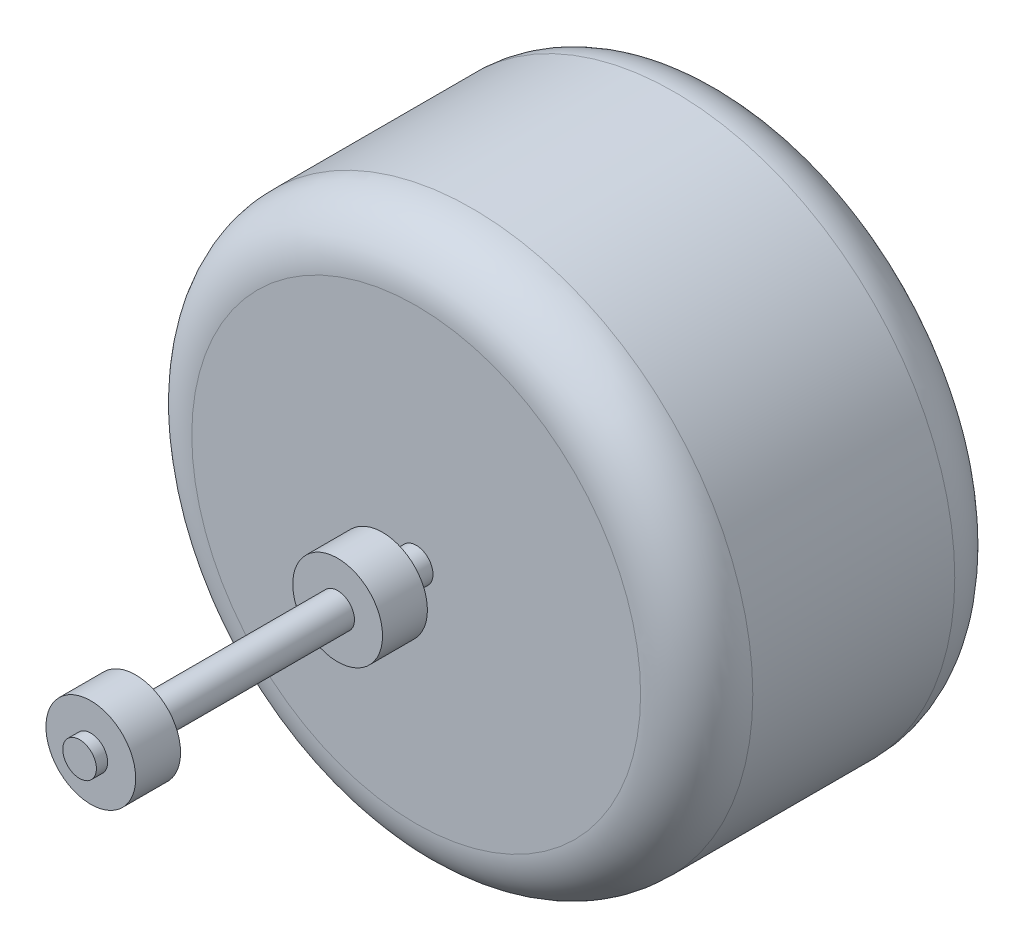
ISO-10303-21;
HEADER;
FILE_DESCRIPTION(('STEP AP214'),'2;1');
FILE_NAME('part.step','',(''),(''),'','','');
FILE_SCHEMA(('AUTOMOTIVE_DESIGN { 1 0 10303 214 1 1 1 1 }'));
ENDSEC;
DATA;
#1=APPLICATION_CONTEXT('core data for automotive mechanical design processes');
#2=APPLICATION_PROTOCOL_DEFINITION('international standard','automotive_design',2000,#1);
#3=PRODUCT_CONTEXT('',#1,'mechanical');
#4=PRODUCT('Part','Part','',(#3));
#5=PRODUCT_RELATED_PRODUCT_CATEGORY('part','',(#4));
#6=PRODUCT_DEFINITION_FORMATION('','',#4);
#7=PRODUCT_DEFINITION_CONTEXT('part definition',#1,'design');
#8=PRODUCT_DEFINITION('design','',#6,#7);
#9=PRODUCT_DEFINITION_SHAPE('','',#8);
#10=(LENGTH_UNIT() NAMED_UNIT(*) SI_UNIT(.MILLI.,.METRE.));
#11=(NAMED_UNIT(*) PLANE_ANGLE_UNIT() SI_UNIT($,.RADIAN.));
#12=(NAMED_UNIT(*) SI_UNIT($,.STERADIAN.) SOLID_ANGLE_UNIT());
#13=UNCERTAINTY_MEASURE_WITH_UNIT(LENGTH_MEASURE(1.E-05),#10,'distance_accuracy_value','');
#14=(GEOMETRIC_REPRESENTATION_CONTEXT(3) GLOBAL_UNCERTAINTY_ASSIGNED_CONTEXT((#13)) GLOBAL_UNIT_ASSIGNED_CONTEXT((#10,
#11,#12)) REPRESENTATION_CONTEXT('',''));
#15=CARTESIAN_POINT('',(0.,0.,0.));
#16=DIRECTION('',(0.,0.,1.));
#17=DIRECTION('',(1.,0.,0.));
#18=AXIS2_PLACEMENT_3D('',#15,#16,#17);
#19=CARTESIAN_POINT('',(0.,0.,44.));
#20=DIRECTION('',(0.,0.,-1.));
#21=DIRECTION('',(-1.,0.,0.));
#22=AXIS2_PLACEMENT_3D('',#19,#20,#21);
#23=CYLINDRICAL_SURFACE('',#22,1.5);
#24=CARTESIAN_POINT('',(0.,0.,21.));
#25=DIRECTION('',(0.,0.,1.));
#26=DIRECTION('',(1.,0.,0.));
#27=AXIS2_PLACEMENT_3D('',#24,#25,#26);
#28=CIRCLE('',#27,1.5);
#29=CARTESIAN_POINT('',(1.5,0.,21.));
#30=VERTEX_POINT('',#29);
#31=EDGE_CURVE('E35',#30,#30,#28,.T.);
#32=ORIENTED_EDGE('',*,*,#31,.T.);
#33=EDGE_LOOP('',(#32));
#34=FACE_BOUND('',#33,.T.);
#35=CARTESIAN_POINT('',(0.,0.,39.));
#36=DIRECTION('',(0.,0.,1.));
#37=DIRECTION('',(1.,0.,0.));
#38=AXIS2_PLACEMENT_3D('',#35,#36,#37);
#39=CIRCLE('',#38,1.5);
#40=CARTESIAN_POINT('',(1.5,0.,39.));
#41=VERTEX_POINT('',#40);
#42=EDGE_CURVE('E39',#41,#41,#39,.T.);
#43=ORIENTED_EDGE('',*,*,#42,.F.);
#44=EDGE_LOOP('',(#43));
#45=FACE_BOUND('',#44,.T.);
#46=ADVANCED_FACE('F31',(#34,#45),#23,.T.);
#47=CARTESIAN_POINT('',(0.,0.,39.));
#48=DIRECTION('',(0.,0.,1.));
#49=DIRECTION('',(1.,0.,0.));
#50=AXIS2_PLACEMENT_3D('',#47,#48,#49);
#51=CYLINDRICAL_SURFACE('',#50,4.);
#52=CARTESIAN_POINT('',(0.,0.,39.));
#53=DIRECTION('',(0.,0.,1.));
#54=DIRECTION('',(1.,0.,0.));
#55=AXIS2_PLACEMENT_3D('',#52,#53,#54);
#56=CIRCLE('',#55,4.);
#57=CARTESIAN_POINT('',(4.,0.,39.));
#58=VERTEX_POINT('',#57);
#59=EDGE_CURVE('E50',#58,#58,#56,.T.);
#60=ORIENTED_EDGE('',*,*,#59,.T.);
#61=EDGE_LOOP('',(#60));
#62=FACE_BOUND('',#61,.T.);
#63=CARTESIAN_POINT('',(0.,0.,43.));
#64=DIRECTION('',(0.,0.,1.));
#65=DIRECTION('',(1.,0.,0.));
#66=AXIS2_PLACEMENT_3D('',#63,#64,#65);
#67=CIRCLE('',#66,4.);
#68=CARTESIAN_POINT('',(4.,0.,43.));
#69=VERTEX_POINT('',#68);
#70=EDGE_CURVE('E67',#69,#69,#67,.T.);
#71=ORIENTED_EDGE('',*,*,#70,.F.);
#72=EDGE_LOOP('',(#71));
#73=FACE_BOUND('',#72,.T.);
#74=ADVANCED_FACE('F99',(#62,#73),#51,.T.);
#75=CARTESIAN_POINT('',(0.,0.,39.));
#76=DIRECTION('',(0.,0.,1.));
#77=DIRECTION('',(1.,0.,0.));
#78=AXIS2_PLACEMENT_3D('',#75,#76,#77);
#79=PLANE('',#78);
#80=ORIENTED_EDGE('',*,*,#42,.T.);
#81=EDGE_LOOP('',(#80));
#82=FACE_BOUND('',#81,.T.);
#83=ORIENTED_EDGE('',*,*,#59,.F.);
#84=EDGE_LOOP('',(#83));
#85=FACE_BOUND('',#84,.T.);
#86=ADVANCED_FACE('F105',(#82,#85),#79,.F.);
#87=CARTESIAN_POINT('',(0.,0.,43.));
#88=DIRECTION('',(0.,0.,1.));
#89=DIRECTION('',(1.,0.,0.));
#90=AXIS2_PLACEMENT_3D('',#87,#88,#89);
#91=PLANE('',#90);
#92=CARTESIAN_POINT('',(0.,0.,43.));
#93=DIRECTION('',(0.,0.,1.));
#94=DIRECTION('',(1.,0.,0.));
#95=AXIS2_PLACEMENT_3D('',#92,#93,#94);
#96=CIRCLE('',#95,1.5);
#97=CARTESIAN_POINT('',(1.5,0.,43.));
#98=VERTEX_POINT('',#97);
#99=EDGE_CURVE('E46',#98,#98,#96,.T.);
#100=ORIENTED_EDGE('',*,*,#99,.F.);
#101=EDGE_LOOP('',(#100));
#102=FACE_BOUND('',#101,.T.);
#103=ORIENTED_EDGE('',*,*,#70,.T.);
#104=EDGE_LOOP('',(#103));
#105=FACE_BOUND('',#104,.T.);
#106=ADVANCED_FACE('F175',(#102,#105),#91,.T.);
#107=CARTESIAN_POINT('',(0.,0.,44.));
#108=DIRECTION('',(0.,0.,1.));
#109=DIRECTION('',(1.,0.,0.));
#110=AXIS2_PLACEMENT_3D('',#107,#108,#109);
#111=PLANE('',#110);
#112=CARTESIAN_POINT('',(0.,0.,44.));
#113=DIRECTION('',(0.,0.,1.));
#114=DIRECTION('',(1.,0.,0.));
#115=AXIS2_PLACEMENT_3D('',#112,#113,#114);
#116=CIRCLE('',#115,1.5);
#117=CARTESIAN_POINT('',(1.5,0.,44.));
#118=VERTEX_POINT('',#117);
#119=EDGE_CURVE('E62',#118,#118,#116,.T.);
#120=ORIENTED_EDGE('',*,*,#119,.T.);
#121=EDGE_LOOP('',(#120));
#122=FACE_BOUND('',#121,.T.);
#123=ADVANCED_FACE('F111',(#122),#111,.T.);
#124=ORIENTED_EDGE('',*,*,#99,.T.);
#125=EDGE_LOOP('',(#124));
#126=FACE_BOUND('',#125,.T.);
#127=ORIENTED_EDGE('',*,*,#119,.F.);
#128=EDGE_LOOP('',(#127));
#129=FACE_BOUND('',#128,.T.);
#130=ADVANCED_FACE('F95',(#126,#129),#23,.T.);
#131=CARTESIAN_POINT('',(0.,0.,21.));
#132=DIRECTION('',(0.,0.,-1.));
#133=DIRECTION('',(-1.,0.,0.));
#134=AXIS2_PLACEMENT_3D('',#131,#132,#133);
#135=CYLINDRICAL_SURFACE('',#134,4.);
#136=CARTESIAN_POINT('',(0.,0.,21.));
#137=DIRECTION('',(0.,0.,1.));
#138=DIRECTION('',(1.,0.,0.));
#139=AXIS2_PLACEMENT_3D('',#136,#137,#138);
#140=CIRCLE('',#139,4.);
#141=CARTESIAN_POINT('',(4.,0.,21.));
#142=VERTEX_POINT('',#141);
#143=EDGE_CURVE('E75',#142,#142,#140,.T.);
#144=ORIENTED_EDGE('',*,*,#143,.F.);
#145=EDGE_LOOP('',(#144));
#146=FACE_BOUND('',#145,.T.);
#147=CARTESIAN_POINT('',(0.,0.,17.));
#148=DIRECTION('',(0.,0.,1.));
#149=DIRECTION('',(1.,0.,0.));
#150=AXIS2_PLACEMENT_3D('',#147,#148,#149);
#151=CIRCLE('',#150,4.);
#152=CARTESIAN_POINT('',(4.,0.,17.));
#153=VERTEX_POINT('',#152);
#154=EDGE_CURVE('E72',#153,#153,#151,.T.);
#155=ORIENTED_EDGE('',*,*,#154,.T.);
#156=EDGE_LOOP('',(#155));
#157=FACE_BOUND('',#156,.T.);
#158=ADVANCED_FACE('F87',(#146,#157),#135,.T.);
#159=CARTESIAN_POINT('',(0.,0.,21.));
#160=DIRECTION('',(0.,0.,1.));
#161=DIRECTION('',(1.,0.,0.));
#162=AXIS2_PLACEMENT_3D('',#159,#160,#161);
#163=PLANE('',#162);
#164=ORIENTED_EDGE('',*,*,#31,.F.);
#165=EDGE_LOOP('',(#164));
#166=FACE_BOUND('',#165,.T.);
#167=ORIENTED_EDGE('',*,*,#143,.T.);
#168=EDGE_LOOP('',(#167));
#169=FACE_BOUND('',#168,.T.);
#170=ADVANCED_FACE('F84',(#166,#169),#163,.T.);
#171=CARTESIAN_POINT('',(0.,0.,17.));
#172=DIRECTION('',(0.,0.,1.));
#173=DIRECTION('',(1.,0.,0.));
#174=AXIS2_PLACEMENT_3D('',#171,#172,#173);
#175=PLANE('',#174);
#176=CARTESIAN_POINT('',(0.,0.,17.));
#177=DIRECTION('',(0.,0.,1.));
#178=DIRECTION('',(1.,0.,0.));
#179=AXIS2_PLACEMENT_3D('',#176,#177,#178);
#180=CIRCLE('',#179,1.5);
#181=CARTESIAN_POINT('',(1.5,0.,17.));
#182=VERTEX_POINT('',#181);
#183=EDGE_CURVE('E10',#182,#182,#180,.T.);
#184=ORIENTED_EDGE('',*,*,#183,.T.);
#185=EDGE_LOOP('',(#184));
#186=FACE_BOUND('',#185,.T.);
#187=ORIENTED_EDGE('',*,*,#154,.F.);
#188=EDGE_LOOP('',(#187));
#189=FACE_BOUND('',#188,.T.);
#190=ADVANCED_FACE('F86',(#186,#189),#175,.F.);
#191=CARTESIAN_POINT('',(0.,0.,-14.));
#192=DIRECTION('',(0.,0.,1.));
#193=DIRECTION('',(1.,0.,0.));
#194=AXIS2_PLACEMENT_3D('',#191,#192,#193);
#195=PLANE('',#194);
#196=CARTESIAN_POINT('',(0.,0.,-14.));
#197=DIRECTION('',(0.,0.,1.));
#198=DIRECTION('',(1.,0.,0.));
#199=AXIS2_PLACEMENT_3D('',#196,#197,#198);
#200=CIRCLE('',#199,20.);
#201=CARTESIAN_POINT('',(20.,0.,-14.));
#202=VERTEX_POINT('',#201);
#203=EDGE_CURVE('E53',#202,#202,#200,.F.);
#204=ORIENTED_EDGE('',*,*,#203,.T.);
#205=EDGE_LOOP('',(#204));
#206=FACE_BOUND('',#205,.T.);
#207=ADVANCED_FACE('F93',(#206),#195,.F.);
#208=CARTESIAN_POINT('',(0.,0.,-9.));
#209=DIRECTION('',(0.,0.,1.));
#210=DIRECTION('',(1.,0.,0.));
#211=AXIS2_PLACEMENT_3D('',#208,#209,#210);
#212=TOROIDAL_SURFACE('',#211,20.,5.);
#213=ORIENTED_EDGE('',*,*,#203,.F.);
#214=EDGE_LOOP('',(#213));
#215=FACE_BOUND('',#214,.T.);
#216=CARTESIAN_POINT('',(0.,0.,-9.));
#217=DIRECTION('',(0.,0.,1.));
#218=DIRECTION('',(1.,0.,0.));
#219=AXIS2_PLACEMENT_3D('',#216,#217,#218);
#220=CIRCLE('',#219,25.);
#221=CARTESIAN_POINT('',(25.,0.,-9.));
#222=VERTEX_POINT('',#221);
#223=EDGE_CURVE('E56',#222,#222,#220,.T.);
#224=ORIENTED_EDGE('',*,*,#223,.F.);
#225=EDGE_LOOP('',(#224));
#226=FACE_BOUND('',#225,.T.);
#227=ADVANCED_FACE('F131',(#215,#226),#212,.T.);
#228=CARTESIAN_POINT('',(0.,0.,14.));
#229=DIRECTION('',(0.,0.,-1.));
#230=DIRECTION('',(-1.,0.,0.));
#231=AXIS2_PLACEMENT_3D('',#228,#229,#230);
#232=CYLINDRICAL_SURFACE('',#231,25.);
#233=ORIENTED_EDGE('',*,*,#223,.T.);
#234=EDGE_LOOP('',(#233));
#235=FACE_BOUND('',#234,.T.);
#236=CARTESIAN_POINT('',(0.,0.,9.));
#237=DIRECTION('',(0.,0.,1.));
#238=DIRECTION('',(1.,0.,0.));
#239=AXIS2_PLACEMENT_3D('',#236,#237,#238);
#240=CIRCLE('',#239,25.);
#241=CARTESIAN_POINT('',(25.,0.,9.));
#242=VERTEX_POINT('',#241);
#243=EDGE_CURVE('E59',#242,#242,#240,.F.);
#244=ORIENTED_EDGE('',*,*,#243,.T.);
#245=EDGE_LOOP('',(#244));
#246=FACE_BOUND('',#245,.T.);
#247=ADVANCED_FACE('F126',(#235,#246),#232,.T.);
#248=CARTESIAN_POINT('',(0.,0.,9.));
#249=DIRECTION('',(0.,0.,1.));
#250=DIRECTION('',(1.,0.,0.));
#251=AXIS2_PLACEMENT_3D('',#248,#249,#250);
#252=TOROIDAL_SURFACE('',#251,20.,5.);
#253=ORIENTED_EDGE('',*,*,#243,.F.);
#254=EDGE_LOOP('',(#253));
#255=FACE_BOUND('',#254,.T.);
#256=CARTESIAN_POINT('',(0.,0.,14.));
#257=DIRECTION('',(0.,0.,1.));
#258=DIRECTION('',(1.,0.,0.));
#259=AXIS2_PLACEMENT_3D('',#256,#257,#258);
#260=CIRCLE('',#259,20.);
#261=CARTESIAN_POINT('',(20.,0.,14.));
#262=VERTEX_POINT('',#261);
#263=EDGE_CURVE('E43',#262,#262,#260,.T.);
#264=ORIENTED_EDGE('',*,*,#263,.F.);
#265=EDGE_LOOP('',(#264));
#266=FACE_BOUND('',#265,.T.);
#267=ADVANCED_FACE('F33',(#255,#266),#252,.T.);
#268=CARTESIAN_POINT('',(0.,0.,14.));
#269=DIRECTION('',(0.,0.,1.));
#270=DIRECTION('',(1.,0.,0.));
#271=AXIS2_PLACEMENT_3D('',#268,#269,#270);
#272=PLANE('',#271);
#273=CARTESIAN_POINT('',(0.,0.,14.));
#274=DIRECTION('',(0.,0.,1.));
#275=DIRECTION('',(1.,0.,0.));
#276=AXIS2_PLACEMENT_3D('',#273,#274,#275);
#277=CIRCLE('',#276,1.5);
#278=CARTESIAN_POINT('',(1.5,0.,14.));
#279=VERTEX_POINT('',#278);
#280=EDGE_CURVE('E49',#279,#279,#277,.T.);
#281=ORIENTED_EDGE('',*,*,#280,.F.);
#282=EDGE_LOOP('',(#281));
#283=FACE_BOUND('',#282,.T.);
#284=ORIENTED_EDGE('',*,*,#263,.T.);
#285=EDGE_LOOP('',(#284));
#286=FACE_BOUND('',#285,.T.);
#287=ADVANCED_FACE('F114',(#283,#286),#272,.T.);
#288=ORIENTED_EDGE('',*,*,#280,.T.);
#289=EDGE_LOOP('',(#288));
#290=FACE_BOUND('',#289,.T.);
#291=ORIENTED_EDGE('',*,*,#183,.F.);
#292=EDGE_LOOP('',(#291));
#293=FACE_BOUND('',#292,.T.);
#294=ADVANCED_FACE('F101',(#290,#293),#23,.T.);
#295=CLOSED_SHELL('',(#46,#74,#86,#106,#123,#130,#158,#170,#190,#207,#227,#247,#267,#287,#294));
#296=MANIFOLD_SOLID_BREP('B2',#295);
#297=ADVANCED_BREP_SHAPE_REPRESENTATION('',(#18,#296),#14);
#298=SHAPE_DEFINITION_REPRESENTATION(#9,#297);
ENDSEC;
END-ISO-10303-21;
